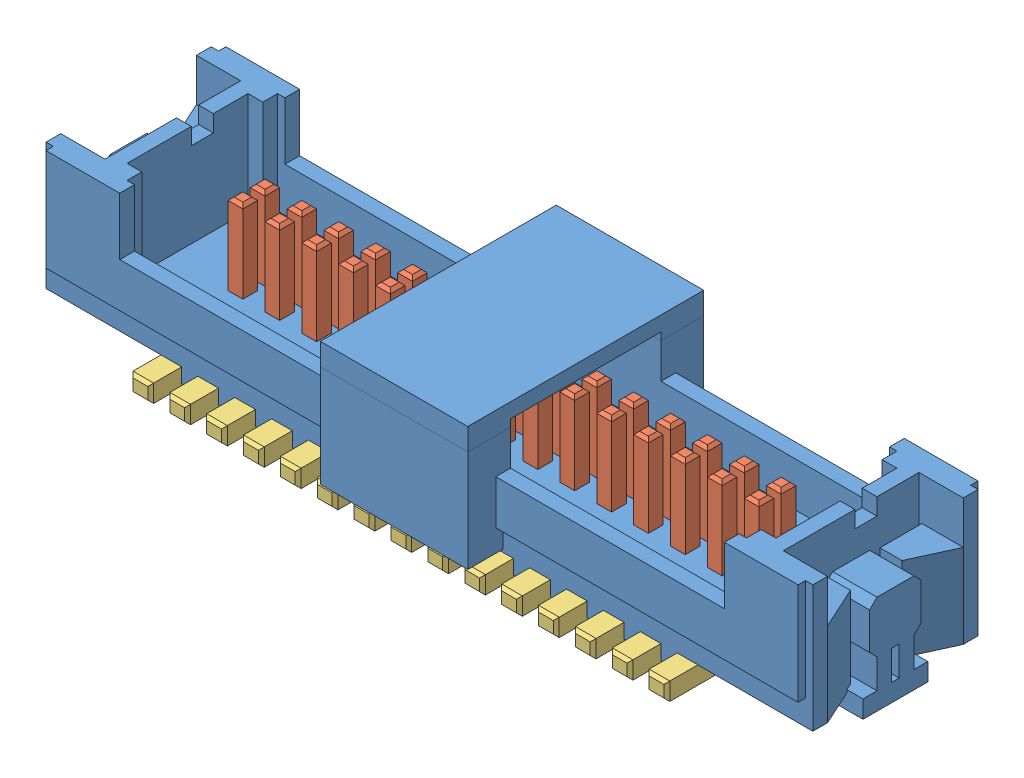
SolidWorks assembly 5p_assem.SLDASM, configuration Default (file format 8000). Lengths in mm.
Overall size (26 4.9 8).
61 component instances, 3 part files, 121 mates.
Components (placement in the parent):
- 5p_adapter-1: 5p_adapter.SLDPRT [Default] at origin size (26 4.8 8)
- pin_top-1: pin_top.SLDPRT [Default] at (-8.75 -3.45 -0.375) size (0.5 2.75 0.5)
- pin_top-32: pin_top.SLDPRT [Default] at (-7.5 -3.45 -0.375) size (0.5 2.75 0.5)
- pin_top-33: pin_top.SLDPRT [Default] at (-6.25 -3.45 -0.375) size (0.5 2.75 0.5)
- pin_top-34: pin_top.SLDPRT [Default] at (-5 -3.45 -0.375) size (0.5 2.75 0.5)
- pin_top-35: pin_top.SLDPRT [Default] at (-3.75 -3.45 -0.375) size (0.5 2.75 0.5)
- pin_top-36: pin_top.SLDPRT [Default] at (-2.5 -3.45 -0.375) size (0.5 2.75 0.5)
- pin_top-37: pin_top.SLDPRT [Default] at (-1.25 -3.45 -0.375) size (0.5 2.75 0.5)
- pin_top-38: pin_top.SLDPRT [Default] at (0 -3.45 -0.375) size (0.5 2.75 0.5)
- pin_top-39: pin_top.SLDPRT [Default] at (1.25 -3.45 -0.375) size (0.5 2.75 0.5)
- pin_top-40: pin_top.SLDPRT [Default] at (2.5 -3.45 -0.375) size (0.5 2.75 0.5)
- pin_top-41: pin_top.SLDPRT [Default] at (3.75 -3.45 -0.375) size (0.5 2.75 0.5)
- pin_top-42: pin_top.SLDPRT [Default] at (5 -3.45 -0.375) size (0.5 2.75 0.5)
- pin_top-43: pin_top.SLDPRT [Default] at (6.25 -3.45 -0.375) size (0.5 2.75 0.5)
- pin_top-44: pin_top.SLDPRT [Default] at (7.5 -3.45 -0.375) size (0.5 2.75 0.5)
- pin_top-45: pin_top.SLDPRT [Default] at (8.75 -3.45 -0.375) size (0.5 2.75 0.5)
- pin_top-49: pin_top.SLDPRT [Default] at (-8.75 -3.45 0.375) size (0.5 2.75 0.5)
- pin_top-53: pin_top.SLDPRT [Default] at (-7.5 -3.45 0.375) size (0.5 2.75 0.5)
- pin_top-54: pin_top.SLDPRT [Default] at (-6.25 -3.45 0.375) size (0.5 2.75 0.5)
- pin_top-55: pin_top.SLDPRT [Default] at (-5 -3.45 0.375) size (0.5 2.75 0.5)
- pin_top-61: pin_top.SLDPRT [Default] at (-3.75 -3.45 0.375) size (0.5 2.75 0.5)
- pin_top-62: pin_top.SLDPRT [Default] at (-2.5 -3.45 0.375) size (0.5 2.75 0.5)
- pin_top-63: pin_top.SLDPRT [Default] at (-1.25 -3.45 0.375) size (0.5 2.75 0.5)
- pin_top-64: pin_top.SLDPRT [Default] at (0 -3.45 0.375) size (0.5 2.75 0.5)
- pin_top-65: pin_top.SLDPRT [Default] at (1.25 -3.45 0.375) size (0.5 2.75 0.5)
- pin_top-66: pin_top.SLDPRT [Default] at (2.5 -3.45 0.375) size (0.5 2.75 0.5)
- pin_top-67: pin_top.SLDPRT [Default] at (3.75 -3.45 0.375) size (0.5 2.75 0.5)
- pin_top-68: pin_top.SLDPRT [Default] at (5 -3.45 0.375) size (0.5 2.75 0.5)
- pin_top-69: pin_top.SLDPRT [Default] at (6.25 -3.45 0.375) size (0.5 2.75 0.5)
- pin_top-70: pin_top.SLDPRT [Default] at (7.5 -3.45 0.375) size (0.5 2.75 0.5)
- pin_top-71: pin_top.SLDPRT [Default] at (8.75 -3.45 0.375) size (0.5 2.75 0.5)
- pin_bot-1: pin_bot.SLDPRT [Default] at (-8.75 -4.9 3) size (0.7 0.6 1.7)
- pin_bot-5: pin_bot.SLDPRT [Default] at (-7.5 -4.9 3) size (0.7 0.6 1.7)
- pin_bot-6: pin_bot.SLDPRT [Default] at (-6.25 -4.9 3) size (0.7 0.6 1.7)
- pin_bot-7: pin_bot.SLDPRT [Default] at (-5 -4.9 3) size (0.7 0.6 1.7)
- pin_bot-8: pin_bot.SLDPRT [Default] at (-3.75 -4.9 3) size (0.7 0.6 1.7)
- pin_bot-9: pin_bot.SLDPRT [Default] at (-2.5 -4.9 3) size (0.7 0.6 1.7)
- pin_bot-10: pin_bot.SLDPRT [Default] at (-1.25 -4.9 3) size (0.7 0.6 1.7)
- pin_bot-12: pin_bot.SLDPRT [Default] at (0 -4.9 3) size (0.7 0.6 1.7)
- pin_bot-13: pin_bot.SLDPRT [Default] at (1.25 -4.9 3) size (0.7 0.6 1.7)
- pin_bot-14: pin_bot.SLDPRT [Default] at (2.5 -4.9 3) size (0.7 0.6 1.7)
- pin_bot-15: pin_bot.SLDPRT [Default] at (3.75 -4.9 3) size (0.7 0.6 1.7)
- pin_bot-16: pin_bot.SLDPRT [Default] at (5 -4.9 3) size (0.7 0.6 1.7)
- pin_bot-17: pin_bot.SLDPRT [Default] at (6.25 -4.9 3) size (0.7 0.6 1.7)
- pin_bot-18: pin_bot.SLDPRT [Default] at (7.5 -4.9 3) size (0.7 0.6 1.7)
- pin_bot-19: pin_bot.SLDPRT [Default] at (8.75 -4.9 3) size (0.7 0.6 1.7)
- pin_bot-20: pin_bot.SLDPRT [Default] at (8.75 -4.9 -3) x (-1 0 0) z (0 0 -1) size (0.7 0.6 1.7)
- pin_bot-21: pin_bot.SLDPRT [Default] at (7.5 -4.9 -3) x (-1 0 0) z (0 0 -1) size (0.7 0.6 1.7)
- pin_bot-22: pin_bot.SLDPRT [Default] at (6.25 -4.9 -3) x (-1 0 0) z (0 0 -1) size (0.7 0.6 1.7)
- pin_bot-23: pin_bot.SLDPRT [Default] at (5 -4.9 -3) x (-1 0 0) z (0 0 -1) size (0.7 0.6 1.7)
- pin_bot-24: pin_bot.SLDPRT [Default] at (3.75 -4.9 -3) x (-1 0 0) z (0 0 -1) size (0.7 0.6 1.7)
- pin_bot-25: pin_bot.SLDPRT [Default] at (2.5 -4.9 -3) x (-1 0 0) z (0 0 -1) size (0.7 0.6 1.7)
- pin_bot-26: pin_bot.SLDPRT [Default] at (1.25 -4.9 -3) x (-1 0 0) z (0 0 -1) size (0.7 0.6 1.7)
- pin_bot-27: pin_bot.SLDPRT [Default] at (0 -4.9 -3) x (-1 0 0) z (0 0 -1) size (0.7 0.6 1.7)
- pin_bot-28: pin_bot.SLDPRT [Default] at (-1.25 -4.9 -3) x (-1 0 0) z (0 0 -1) size (0.7 0.6 1.7)
- pin_bot-29: pin_bot.SLDPRT [Default] at (-2.5 -4.9 -3) x (-1 0 0) z (0 0 -1) size (0.7 0.6 1.7)
- pin_bot-30: pin_bot.SLDPRT [Default] at (-3.75 -4.9 -3) x (-1 0 0) z (0 0 -1) size (0.7 0.6 1.7)
- pin_bot-31: pin_bot.SLDPRT [Default] at (-5 -4.9 -3) x (-1 0 0) z (0 0 -1) size (0.7 0.6 1.7)
- pin_bot-32: pin_bot.SLDPRT [Default] at (-6.25 -4.9 -3) x (-1 0 0) z (0 0 -1) size (0.7 0.6 1.7)
- pin_bot-33: pin_bot.SLDPRT [Default] at (-7.5 -4.9 -3) x (-1 0 0) z (0 0 -1) size (0.7 0.6 1.7)
- pin_bot-35: pin_bot.SLDPRT [Default] at (-8.75 -4.9 -3) x (-1 0 0) z (0 0 -1) size (0.7 0.6 1.7)
Mates (geometry in assembly coordinates):
- Coincident1: coordinate: point of 5p_adapter-1; point of assembly
- Coincident2: coincident anti-aligned: line of 5p_adapter-1 through (-8.5 -3.45 -0.625) axis (0 0 1); line of pin_top-1 through (-8.5 -3.45 -0.125) axis (0 0 -1)
- Coincident3: coincident aligned: line of 5p_adapter-1 through (-9 -3.45 -0.125) axis (1 0 0); line of pin_top-1 through (-9 -3.45 -0.125) axis (1 0 0)
- Coincident4: coincident aligned: line of 5p_adapter-1 through (-9 -3.45 -0.125) axis (1 0 0); line of pin_top-32 through (-7.75 -3.45 -0.125) axis (1 0 0)
- Coincident5: coincident anti-aligned: line of 5p_adapter-1 through (-7.25 -3.45 -0.625) axis (0 0 1); line of pin_top-32 through (-7.25 -3.45 -0.125) axis (0 0 -1)
- Coincident6: coincident aligned: line of 5p_adapter-1 through (-9 -3.45 -0.125) axis (1 0 0); line of pin_top-33 through (-6.5 -3.45 -0.125) axis (1 0 0)
- Coincident7: coincident anti-aligned: line of 5p_adapter-1 through (-6 -3.45 -0.625) axis (0 0 1); line of pin_top-33 through (-6 -3.45 -0.125) axis (0 0 -1)
- Coincident8: coincident aligned: line of 5p_adapter-1 through (-9 -3.45 -0.125) axis (1 0 0); line of pin_top-34 through (-5.25 -3.45 -0.125) axis (1 0 0)
- Coincident10: coincident anti-aligned: line of 5p_adapter-1 through (-4.75 -3.45 -0.625) axis (0 0 1); line of pin_top-34 through (-4.75 -3.45 -0.125) axis (0 0 -1)
- Coincident11: coincident aligned: line of 5p_adapter-1 through (-9 -3.45 -0.125) axis (1 0 0); line of pin_top-35 through (-4 -3.45 -0.125) axis (1 0 0)
- Coincident12: coincident anti-aligned: line of 5p_adapter-1 through (-3.5 -3.45 -0.625) axis (0 0 1); line of pin_top-35 through (-3.5 -3.45 -0.125) axis (0 0 -1)
- Coincident13: coincident aligned: line of 5p_adapter-1 through (-9 -3.45 -0.125) axis (1 0 0); line of pin_top-36 through (-2.75 -3.45 -0.125) axis (1 0 0)
- Coincident15: coincident anti-aligned: line of 5p_adapter-1 through (-2.25 -3.45 -0.625) axis (0 0 1); line of pin_top-36 through (-2.25 -3.45 -0.125) axis (0 0 -1)
- Coincident16: coincident aligned: line of 5p_adapter-1 through (-9 -3.45 -0.125) axis (1 0 0); line of pin_top-37 through (-1.5 -3.45 -0.125) axis (1 0 0)
- Coincident17: coincident anti-aligned: line of 5p_adapter-1 through (-1 -3.45 -0.625) axis (0 0 1); line of pin_top-37 through (-1 -3.45 -0.125) axis (0 0 -1)
- Coincident18: coincident aligned: line of 5p_adapter-1 through (-9 -3.45 -0.125) axis (1 0 0); line of pin_top-38 through (-0.25 -3.45 -0.125) axis (1 0 0)
- Coincident19: coincident anti-aligned: line of 5p_adapter-1 through (0.25 -3.45 -0.625) axis (0 0 1); line of pin_top-38 through (0.25 -3.45 -0.125) axis (0 0 -1)
- Coincident20: coincident aligned: line of 5p_adapter-1 through (-9 -3.45 -0.125) axis (1 0 0); line of pin_top-39 through (1 -3.45 -0.125) axis (1 0 0)
- Coincident21: coincident anti-aligned: line of 5p_adapter-1 through (1.5 -3.45 -0.625) axis (0 0 1); line of pin_top-39 through (1.5 -3.45 -0.125) axis (0 0 -1)
- Coincident22: coincident aligned: line of 5p_adapter-1 through (-9 -3.45 -0.125) axis (1 0 0); line of pin_top-40 through (2.25 -3.45 -0.125) axis (1 0 0)
- Coincident23: coincident anti-aligned: line of 5p_adapter-1 through (2.75 -3.45 -0.625) axis (0 0 1); line of pin_top-40 through (2.75 -3.45 -0.125) axis (0 0 -1)
- Coincident24: coincident aligned: line of 5p_adapter-1 through (-9 -3.45 -0.125) axis (1 0 0); line of pin_top-41 through (3.5 -3.45 -0.125) axis (1 0 0)
- Coincident25: coincident anti-aligned: line of 5p_adapter-1 through (4 -3.45 -0.625) axis (0 0 1); line of pin_top-41 through (4 -3.45 -0.125) axis (0 0 -1)
- Coincident26: coincident aligned: line of 5p_adapter-1 through (-9 -3.45 -0.125) axis (1 0 0); line of pin_top-42 through (4.75 -3.45 -0.125) axis (1 0 0)
- Coincident27: coincident anti-aligned: line of 5p_adapter-1 through (5.25 -3.45 -0.625) axis (0 0 1); line of pin_top-42 through (5.25 -3.45 -0.125) axis (0 0 -1)
- Coincident28: coincident aligned: line of 5p_adapter-1 through (-9 -3.45 -0.125) axis (1 0 0); line of pin_top-43 through (6 -3.45 -0.125) axis (1 0 0)
- Coincident29: coincident anti-aligned: line of 5p_adapter-1 through (6.5 -3.45 -0.625) axis (0 0 1); line of pin_top-43 through (6.5 -3.45 -0.125) axis (0 0 -1)
- Coincident30: coincident aligned: line of 5p_adapter-1 through (-9 -3.45 -0.125) axis (1 0 0); line of pin_top-44 through (7.25 -3.45 -0.125) axis (1 0 0)
- Coincident31: coincident anti-aligned: line of 5p_adapter-1 through (7.75 -3.45 -0.625) axis (0 0 1); line of pin_top-44 through (7.75 -3.45 -0.125) axis (0 0 -1)
- Coincident32: coincident aligned: line of 5p_adapter-1 through (-9 -3.45 -0.125) axis (1 0 0); line of pin_top-45 through (8.5 -3.45 -0.125) axis (1 0 0)
- Coincident33: coincident anti-aligned: line of 5p_adapter-1 through (9 -3.45 -0.625) axis (0 0 1); line of pin_top-45 through (9 -3.45 -0.125) axis (0 0 -1)
- Coincident41: coincident aligned: line of 5p_adapter-1 through (-9 -3.45 0.625) axis (1 0 0); line of pin_top-49 through (-9 -3.45 0.625) axis (1 0 0)
- Coincident42: coincident aligned: line of 5p_adapter-1 through (-8.5 -3.45 0.625) axis (0 0 -1); line of pin_top-49 through (-8.5 -3.45 0.625) axis (0 0 -1)
- Coincident51: coincident aligned: line of 5p_adapter-1 through (-7.25 -3.45 0.625) axis (0 0 -1); line of pin_top-53 through (-7.25 -3.45 0.625) axis (0 0 -1)
- Coincident53: coincident aligned: line of 5p_adapter-1 through (-9 -3.45 0.625) axis (1 0 0); line of pin_top-53 through (-7.75 -3.45 0.625) axis (1 0 0)
- Coincident54: coincident aligned: line of 5p_adapter-1 through (-9 -3.45 0.625) axis (1 0 0); line of pin_top-54 through (-6.5 -3.45 0.625) axis (1 0 0)
- Coincident55: coincident aligned: line of 5p_adapter-1 through (-6 -3.45 0.625) axis (0 0 -1); line of pin_top-54 through (-6 -3.45 0.625) axis (0 0 -1)
- Coincident56: coincident aligned: line of 5p_adapter-1 through (-9 -3.45 0.625) axis (1 0 0); line of pin_top-55 through (-5.25 -3.45 0.625) axis (1 0 0)
- Coincident57: coincident aligned: line of 5p_adapter-1 through (-4.75 -3.45 0.625) axis (0 0 -1); line of pin_top-55 through (-4.75 -3.45 0.625) axis (0 0 -1)
- Coincident66: coincident aligned: line of 5p_adapter-1 through (-4 -3.45 0.625) axis (1 0 0); line of pin_top-61 through (-4 -3.45 0.625) axis (1 0 0)
- Coincident67: coincident aligned: line of 5p_adapter-1 through (-3.5 -3.45 0.625) axis (0 0 -1); line of pin_top-61 through (-3.5 -3.45 0.625) axis (0 0 -1)
- Coincident68: coincident aligned: line of 5p_adapter-1 through (-9 -3.45 0.625) axis (1 0 0); line of pin_top-62 through (-2.75 -3.45 0.625) axis (1 0 0)
- Coincident69: coincident aligned: line of 5p_adapter-1 through (-2.25 -3.45 0.625) axis (0 0 -1); line of pin_top-62 through (-2.25 -3.45 0.625) axis (0 0 -1)
- Coincident70: coincident aligned: line of 5p_adapter-1 through (-9 -3.45 0.625) axis (1 0 0); line of pin_top-63 through (-1.5 -3.45 0.625) axis (1 0 0)
- Coincident71: coincident aligned: line of 5p_adapter-1 through (-1 -3.45 0.625) axis (0 0 -1); line of pin_top-63 through (-1 -3.45 0.625) axis (0 0 -1)
- Coincident72: coincident aligned: line of 5p_adapter-1 through (-9 -3.45 0.625) axis (1 0 0); line of pin_top-64 through (-0.25 -3.45 0.625) axis (1 0 0)
- Coincident73: coincident aligned: line of 5p_adapter-1 through (0.25 -3.45 0.625) axis (0 0 -1); line of pin_top-64 through (0.25 -3.45 0.625) axis (0 0 -1)
- Coincident74: coincident aligned: line of 5p_adapter-1 through (-9 -3.45 0.625) axis (1 0 0); line of pin_top-65 through (1 -3.45 0.625) axis (1 0 0)
- Coincident75: coincident aligned: line of 5p_adapter-1 through (1.5 -3.45 0.625) axis (0 0 -1); line of pin_top-65 through (1.5 -3.45 0.625) axis (0 0 -1)
- Coincident76: coincident aligned: line of 5p_adapter-1 through (-9 -3.45 0.625) axis (1 0 0); line of pin_top-66 through (2.25 -3.45 0.625) axis (1 0 0)
- Coincident77: coincident aligned: line of 5p_adapter-1 through (2.75 -3.45 0.625) axis (0 0 -1); line of pin_top-66 through (2.75 -3.45 0.625) axis (0 0 -1)
- Coincident78: coincident aligned: line of 5p_adapter-1 through (-9 -3.45 0.625) axis (1 0 0); line of pin_top-67 through (3.5 -3.45 0.625) axis (1 0 0)
- Coincident79: coincident aligned: line of 5p_adapter-1 through (4 -3.45 0.625) axis (0 0 -1); line of pin_top-67 through (4 -3.45 0.625) axis (0 0 -1)
- Coincident80: coincident aligned: line of 5p_adapter-1 through (-9 -3.45 0.625) axis (1 0 0); line of pin_top-68 through (4.75 -3.45 0.625) axis (1 0 0)
- Coincident81: coincident aligned: line of 5p_adapter-1 through (5.25 -3.45 0.625) axis (0 0 -1); line of pin_top-68 through (5.25 -3.45 0.625) axis (0 0 -1)
- Coincident82: coincident aligned: line of 5p_adapter-1 through (-9 -3.45 0.625) axis (1 0 0); line of pin_top-69 through (6 -3.45 0.625) axis (1 0 0)
- Coincident83: coincident aligned: line of 5p_adapter-1 through (6.5 -3.45 0.625) axis (0 0 -1); line of pin_top-69 through (6.5 -3.45 0.625) axis (0 0 -1)
- Coincident84: coincident aligned: line of 5p_adapter-1 through (-9 -3.45 0.625) axis (1 0 0); line of pin_top-70 through (7.25 -3.45 0.625) axis (1 0 0)
- Coincident85: coincident aligned: line of 5p_adapter-1 through (7.75 -3.45 0.625) axis (0 0 -1); line of pin_top-70 through (7.75 -3.45 0.625) axis (0 0 -1)
- Coincident86: coincident aligned: line of 5p_adapter-1 through (-9 -3.45 0.625) axis (1 0 0); line of pin_top-71 through (8.5 -3.45 0.625) axis (1 0 0)
- Coincident87: coincident aligned: line of 5p_adapter-1 through (9 -3.45 0.625) axis (0 0 -1); line of pin_top-71 through (9 -3.45 0.625) axis (0 0 -1)
- Coincident90: coincident anti-aligned: line of 5p_adapter-1 through (-8.4 -4.3 2.15) axis (0 0 1); line of pin_bot-1 through (-8.4 -4.3 3.75) axis (0 0 -1)
- Coincident91: coincident anti-aligned: line of 5p_adapter-1 through (-9.1 -4.3 2.15) axis (1 0 0); line of pin_bot-1 through (-8.4 -4.3 2.15) axis (-1 0 0)
- Coincident99: coincident anti-aligned: line of 5p_adapter-1 through (-7.15 -4.3 2.15) axis (0 0 1); line of pin_bot-5 through (-7.15 -4.3 3.75) axis (0 0 -1)
- Coincident100: coincident anti-aligned: line of 5p_adapter-1 through (-7.85 -4.3 2.15) axis (1 0 0); line of pin_bot-5 through (-7.15 -4.3 2.15) axis (-1 0 0)
- Coincident102: coincident anti-aligned: line of 5p_adapter-1 through (-6.6 -4.3 2.15) axis (1 0 0); line of pin_bot-6 through (-5.9 -4.3 2.15) axis (-1 0 0)
- Coincident104: coincident anti-aligned: line of 5p_adapter-1 through (-5.9 -4.3 2.15) axis (0 0 1); line of pin_bot-6 through (-5.9 -4.3 3.75) axis (0 0 -1)
- Coincident105: coincident anti-aligned: line of 5p_adapter-1 through (-4.65 -4.3 2.15) axis (0 0 1); line of pin_bot-7 through (-4.65 -4.3 3.75) axis (0 0 -1)
- Coincident106: coincident anti-aligned: line of 5p_adapter-1 through (-5.35 -4.3 2.15) axis (1 0 0); line of pin_bot-7 through (-4.65 -4.3 2.15) axis (-1 0 0)
- Coincident108: coincident anti-aligned: line of 5p_adapter-1 through (-4.1 -4.3 2.15) axis (1 0 0); line of pin_bot-8 through (-3.4 -4.3 2.15) axis (-1 0 0)
- Coincident109: coincident anti-aligned: line of 5p_adapter-1 through (-3.4 -4.3 2.15) axis (0 0 1); line of pin_bot-8 through (-3.4 -4.3 3.75) axis (0 0 -1)
- Coincident110: coincident anti-aligned: line of 5p_adapter-1 through (-2.15 -4.3 2.15) axis (0 0 1); line of pin_bot-9 through (-2.15 -4.3 3.75) axis (0 0 -1)
- Coincident111: coincident anti-aligned: line of 5p_adapter-1 through (-2.85 -4.3 2.15) axis (1 0 0); line of pin_bot-9 through (-2.15 -4.3 2.15) axis (-1 0 0)
- Coincident112: coincident anti-aligned: line of 5p_adapter-1 through (-0.9 -4.3 2.15) axis (0 0 1); line of pin_bot-10 through (-0.9 -4.3 3.75) axis (0 0 -1)
- Coincident113: coincident anti-aligned: line of 5p_adapter-1 through (-1.6 -4.3 2.15) axis (1 0 0); line of pin_bot-10 through (-0.9 -4.3 2.15) axis (-1 0 0)
- Coincident116: coincident anti-aligned: line of 5p_adapter-1 through (0.35 -4.3 2.15) axis (0 0 1); line of pin_bot-12 through (0.35 -4.3 3.75) axis (0 0 -1)
- Coincident117: coincident anti-aligned: line of 5p_adapter-1 through (-0.35 -4.3 2.15) axis (1 0 0); line of pin_bot-12 through (0.35 -4.3 2.15) axis (-1 0 0)
- Coincident118: coincident anti-aligned: line of 5p_adapter-1 through (1.6 -4.3 2.15) axis (0 0 1); line of pin_bot-13 through (1.6 -4.3 3.75) axis (0 0 -1)
- Coincident119: coincident anti-aligned: line of 5p_adapter-1 through (0.9 -4.3 2.15) axis (1 0 0); line of pin_bot-13 through (1.6 -4.3 2.15) axis (-1 0 0)
- Coincident120: coincident anti-aligned: line of 5p_adapter-1 through (2.85 -4.3 2.15) axis (0 0 1); line of pin_bot-14 through (2.85 -4.3 3.75) axis (0 0 -1)
- Coincident121: coincident anti-aligned: line of 5p_adapter-1 through (2.15 -4.3 2.15) axis (1 0 0); line of pin_bot-14 through (2.85 -4.3 2.15) axis (-1 0 0)
- Coincident122: coincident anti-aligned: line of 5p_adapter-1 through (4.1 -4.3 2.15) axis (0 0 1); line of pin_bot-15 through (4.1 -4.3 3.75) axis (0 0 -1)
- Coincident123: coincident anti-aligned: line of 5p_adapter-1 through (3.4 -4.3 2.15) axis (1 0 0); line of pin_bot-15 through (4.1 -4.3 2.15) axis (-1 0 0)
- Coincident124: coincident anti-aligned: line of 5p_adapter-1 through (5.35 -4.3 2.15) axis (0 0 1); line of pin_bot-16 through (5.35 -4.3 3.75) axis (0 0 -1)
- Coincident125: coincident anti-aligned: line of 5p_adapter-1 through (4.65 -4.3 2.15) axis (1 0 0); line of pin_bot-16 through (5.35 -4.3 2.15) axis (-1 0 0)
- Coincident126: coincident anti-aligned: line of 5p_adapter-1 through (6.6 -4.3 2.15) axis (0 0 1); line of pin_bot-17 through (6.6 -4.3 3.75) axis (0 0 -1)
- Coincident127: coincident anti-aligned: line of 5p_adapter-1 through (5.9 -4.3 2.15) axis (1 0 0); line of pin_bot-17 through (6.6 -4.3 2.15) axis (-1 0 0)
- Coincident128: coincident anti-aligned: line of 5p_adapter-1 through (7.85 -4.3 2.15) axis (0 0 1); line of pin_bot-18 through (7.85 -4.3 3.75) axis (0 0 -1)
- Coincident129: coincident anti-aligned: line of 5p_adapter-1 through (7.15 -4.3 2.15) axis (1 0 0); line of pin_bot-18 through (7.85 -4.3 2.15) axis (-1 0 0)
- Coincident130: coincident anti-aligned: line of 5p_adapter-1 through (8.4 -4.3 2.8) axis (0 0 -1); line of pin_bot-19 through (8.4 -4.3 2.15) axis (0 0 1)
- Coincident131: coincident anti-aligned: line of 5p_adapter-1 through (8.4 -4.3 2.15) axis (1 0 0); line of pin_bot-19 through (9.1 -4.3 2.15) axis (-1 0 0)
- Coincident132: coincident anti-aligned: line of 5p_adapter-1 through (9.1 -4.3 -2.15) axis (-1 0 0); line of pin_bot-20 through (8.4 -4.3 -2.15) axis (1 0 0)
- Coincident133: coincident anti-aligned: line of 5p_adapter-1 through (8.4 -4.3 -2.15) axis (0 0 -1); line of pin_bot-20 through (8.4 -4.3 -3.75) axis (0 0 1)
- Coincident134: coincident anti-aligned: line of 5p_adapter-1 through (7.85 -4.3 -2.15) axis (-1 0 0); line of pin_bot-21 through (7.15 -4.3 -2.15) axis (1 0 0)
- Coincident135: coincident anti-aligned: line of 5p_adapter-1 through (7.15 -4.3 -2.15) axis (0 0 -1); line of pin_bot-21 through (7.15 -4.3 -3.75) axis (0 0 1)
- Coincident136: coincident anti-aligned: line of 5p_adapter-1 through (5.9 -4.3 -2.15) axis (0 0 -1); line of pin_bot-22 through (5.9 -4.3 -3.75) axis (0 0 1)
- Coincident137: coincident anti-aligned: line of 5p_adapter-1 through (9.1 -4.3 -2.15) axis (-1 0 0); line of pin_bot-22 through (5.9 -4.3 -2.15) axis (1 0 0)
- Coincident138: coincident anti-aligned: line of 5p_adapter-1 through (9.1 -4.3 -2.15) axis (-1 0 0); line of pin_bot-23 through (4.65 -4.3 -2.15) axis (1 0 0)
- Coincident139: coincident anti-aligned: line of 5p_adapter-1 through (4.65 -4.3 -2.15) axis (0 0 -1); line of pin_bot-23 through (4.65 -4.3 -3.75) axis (0 0 1)
- Coincident140: coincident anti-aligned: line of 5p_adapter-1 through (9.1 -4.3 -2.15) axis (-1 0 0); line of pin_bot-24 through (3.4 -4.3 -2.15) axis (1 0 0)
- Coincident141: coincident anti-aligned: line of 5p_adapter-1 through (3.4 -4.3 -2.15) axis (0 0 -1); line of pin_bot-24 through (3.4 -4.3 -3.75) axis (0 0 1)
- Coincident142: coincident anti-aligned: line of 5p_adapter-1 through (9.1 -4.3 -2.15) axis (-1 0 0); line of pin_bot-25 through (2.15 -4.3 -2.15) axis (1 0 0)
- Coincident143: coincident anti-aligned: line of 5p_adapter-1 through (2.15 -4.3 -2.15) axis (0 0 -1); line of pin_bot-25 through (2.15 -4.3 -3.75) axis (0 0 1)
- Coincident144: coincident anti-aligned: line of 5p_adapter-1 through (9.1 -4.3 -2.15) axis (-1 0 0); line of pin_bot-26 through (0.9 -4.3 -2.15) axis (1 0 0)
- Coincident145: coincident anti-aligned: line of 5p_adapter-1 through (0.9 -4.3 -2.15) axis (0 0 -1); line of pin_bot-26 through (0.9 -4.3 -3.75) axis (0 0 1)
- Coincident146: coincident anti-aligned: line of 5p_adapter-1 through (9.1 -4.3 -2.15) axis (-1 0 0); line of pin_bot-27 through (-0.35 -4.3 -2.15) axis (1 0 0)
- Coincident147: coincident anti-aligned: line of 5p_adapter-1 through (-0.35 -4.3 -2.15) axis (0 0 -1); line of pin_bot-27 through (-0.35 -4.3 -3.75) axis (0 0 1)
- Coincident148: coincident anti-aligned: line of 5p_adapter-1 through (9.1 -4.3 -2.15) axis (-1 0 0); line of pin_bot-28 through (-1.6 -4.3 -2.15) axis (1 0 0)
- Coincident149: coincident anti-aligned: line of 5p_adapter-1 through (-1.6 -4.3 -2.15) axis (0 0 -1); line of pin_bot-28 through (-1.6 -4.3 -3.75) axis (0 0 1)
- Coincident150: coincident anti-aligned: line of 5p_adapter-1 through (9.1 -4.3 -2.15) axis (-1 0 0); line of pin_bot-29 through (-2.85 -4.3 -2.15) axis (1 0 0)
- Coincident151: coincident anti-aligned: line of 5p_adapter-1 through (-2.85 -4.3 -2.15) axis (0 0 -1); line of pin_bot-29 through (-2.85 -4.3 -3.75) axis (0 0 1)
- Coincident152: coincident anti-aligned: line of 5p_adapter-1 through (9.1 -4.3 -2.15) axis (-1 0 0); line of pin_bot-30 through (-4.1 -4.3 -2.15) axis (1 0 0)
- Coincident153: coincident anti-aligned: line of 5p_adapter-1 through (-4.1 -4.3 -2.15) axis (0 0 -1); line of pin_bot-30 through (-4.1 -4.3 -3.75) axis (0 0 1)
- Coincident154: coincident anti-aligned: line of 5p_adapter-1 through (9.1 -4.3 -2.15) axis (-1 0 0); line of pin_bot-31 through (-5.35 -4.3 -2.15) axis (1 0 0)
- Coincident155: coincident anti-aligned: line of 5p_adapter-1 through (-5.35 -4.3 -2.15) axis (0 0 -1); line of pin_bot-31 through (-5.35 -4.3 -3.75) axis (0 0 1)
- Coincident156: coincident anti-aligned: line of 5p_adapter-1 through (9.1 -4.3 -2.15) axis (-1 0 0); line of pin_bot-32 through (-6.6 -4.3 -2.15) axis (1 0 0)
- Coincident157: coincident anti-aligned: line of 5p_adapter-1 through (-6.6 -4.3 -2.15) axis (0 0 -1); line of pin_bot-32 through (-6.6 -4.3 -3.75) axis (0 0 1)
- Coincident158: coincident anti-aligned: line of 5p_adapter-1 through (9.1 -4.3 -2.15) axis (-1 0 0); line of pin_bot-33 through (-7.85 -4.3 -2.15) axis (1 0 0)
- Coincident159: coincident anti-aligned: line of 5p_adapter-1 through (-7.85 -4.3 -2.15) axis (0 0 -1); line of pin_bot-33 through (-7.85 -4.3 -3.75) axis (0 0 1)
- Coincident161: coincident anti-aligned: line of 5p_adapter-1 through (-8.4 -4.3 -2.15) axis (-1 0 0); line of pin_bot-35 through (-9.1 -4.3 -2.15) axis (1 0 0)
- Coincident162: coincident aligned: line of 5p_adapter-1 through (-8.4 -4.3 -2.15) axis (0 -1 0); line of pin_bot-35 through (-8.4 -4.3 -2.15) axis (0 -1 0)
